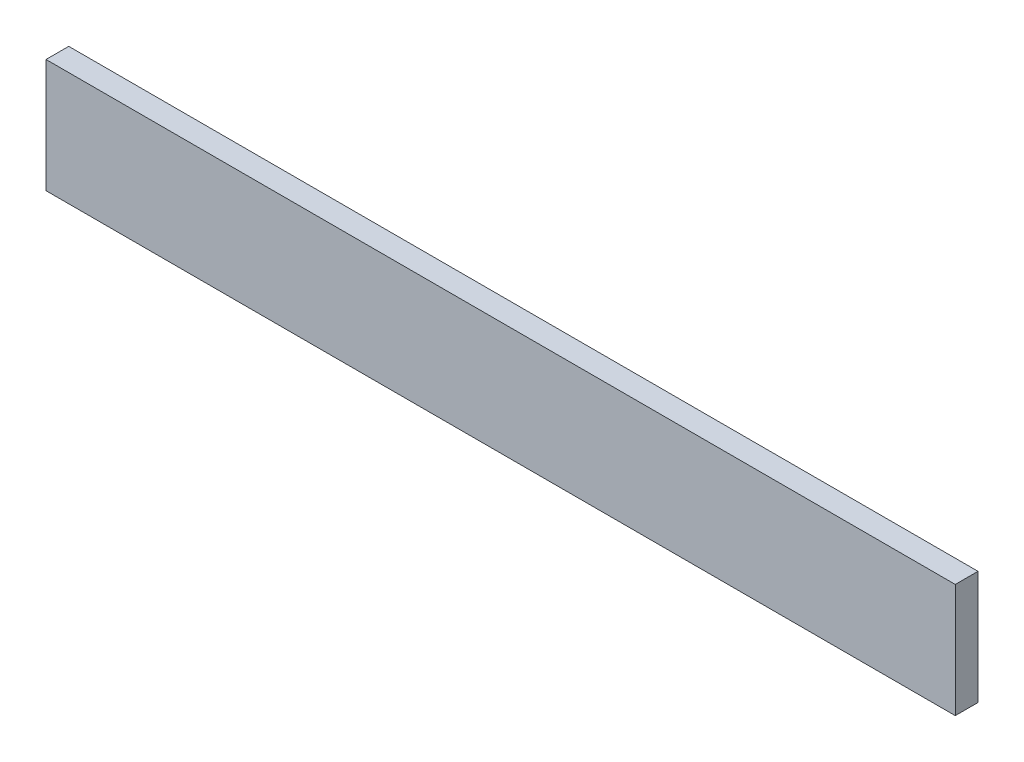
ISO-10303-21;
HEADER;
FILE_DESCRIPTION(('STEP AP214'),'2;1');
FILE_NAME('part.step','',(''),(''),'','','');
FILE_SCHEMA(('AUTOMOTIVE_DESIGN { 1 0 10303 214 1 1 1 1 }'));
ENDSEC;
DATA;
#1=APPLICATION_CONTEXT('core data for automotive mechanical design processes');
#2=APPLICATION_PROTOCOL_DEFINITION('international standard','automotive_design',2000,#1);
#3=PRODUCT_CONTEXT('',#1,'mechanical');
#4=PRODUCT('Part','Part','',(#3));
#5=PRODUCT_RELATED_PRODUCT_CATEGORY('part','',(#4));
#6=PRODUCT_DEFINITION_FORMATION('','',#4);
#7=PRODUCT_DEFINITION_CONTEXT('part definition',#1,'design');
#8=PRODUCT_DEFINITION('design','',#6,#7);
#9=PRODUCT_DEFINITION_SHAPE('','',#8);
#10=(LENGTH_UNIT() NAMED_UNIT(*) SI_UNIT(.MILLI.,.METRE.));
#11=(NAMED_UNIT(*) PLANE_ANGLE_UNIT() SI_UNIT($,.RADIAN.));
#12=(NAMED_UNIT(*) SI_UNIT($,.STERADIAN.) SOLID_ANGLE_UNIT());
#13=UNCERTAINTY_MEASURE_WITH_UNIT(LENGTH_MEASURE(1.E-05),#10,'distance_accuracy_value','');
#14=(GEOMETRIC_REPRESENTATION_CONTEXT(3) GLOBAL_UNCERTAINTY_ASSIGNED_CONTEXT((#13)) GLOBAL_UNIT_ASSIGNED_CONTEXT((#10,
#11,#12)) REPRESENTATION_CONTEXT('',''));
#15=CARTESIAN_POINT('',(0.,0.,0.));
#16=DIRECTION('',(0.,0.,1.));
#17=DIRECTION('',(1.,0.,0.));
#18=AXIS2_PLACEMENT_3D('',#15,#16,#17);
#19=CARTESIAN_POINT('',(0.,12.7,0.));
#20=DIRECTION('',(1.,0.,0.));
#21=DIRECTION('',(0.,0.,-1.));
#22=AXIS2_PLACEMENT_3D('',#19,#20,#21);
#23=PLANE('',#22);
#24=DIRECTION('',(0.,0.,1.));
#25=VECTOR('',#24,1.);
#26=CARTESIAN_POINT('',(0.,0.,0.));
#27=LINE('',#26,#25);
#28=CARTESIAN_POINT('',(0.,0.,-2.54));
#29=VERTEX_POINT('',#28);
#30=CARTESIAN_POINT('',(0.,0.,0.));
#31=VERTEX_POINT('',#30);
#32=EDGE_CURVE('E94',#29,#31,#27,.T.);
#33=ORIENTED_EDGE('',*,*,#32,.T.);
#34=DIRECTION('',(0.,-1.,0.));
#35=VECTOR('',#34,1.);
#36=CARTESIAN_POINT('',(0.,12.7,0.));
#37=LINE('',#36,#35);
#38=CARTESIAN_POINT('',(0.,12.7,0.));
#39=VERTEX_POINT('',#38);
#40=EDGE_CURVE('E11',#39,#31,#37,.T.);
#41=ORIENTED_EDGE('',*,*,#40,.F.);
#42=DIRECTION('',(0.,0.,1.));
#43=VECTOR('',#42,1.);
#44=CARTESIAN_POINT('',(0.,12.7,0.));
#45=LINE('',#44,#43);
#46=CARTESIAN_POINT('',(0.,12.7,-2.54));
#47=VERTEX_POINT('',#46);
#48=EDGE_CURVE('E82',#47,#39,#45,.T.);
#49=ORIENTED_EDGE('',*,*,#48,.F.);
#50=DIRECTION('',(0.,-1.,0.));
#51=VECTOR('',#50,1.);
#52=CARTESIAN_POINT('',(0.,12.7,-2.54));
#53=LINE('',#52,#51);
#54=EDGE_CURVE('E90',#47,#29,#53,.T.);
#55=ORIENTED_EDGE('',*,*,#54,.T.);
#56=EDGE_LOOP('',(#33,#41,#49,#55));
#57=FACE_BOUND('',#56,.T.);
#58=ADVANCED_FACE('F31',(#57),#23,.F.);
#59=CARTESIAN_POINT('',(0.,12.7,0.));
#60=DIRECTION('',(0.,0.,-1.));
#61=DIRECTION('',(-1.,0.,0.));
#62=AXIS2_PLACEMENT_3D('',#59,#60,#61);
#63=PLANE('',#62);
#64=DIRECTION('',(1.,0.,0.));
#65=VECTOR('',#64,1.);
#66=CARTESIAN_POINT('',(0.,0.,0.));
#67=LINE('',#66,#65);
#68=CARTESIAN_POINT('',(101.6,0.,0.));
#69=VERTEX_POINT('',#68);
#70=EDGE_CURVE('E86',#31,#69,#67,.T.);
#71=ORIENTED_EDGE('',*,*,#70,.T.);
#72=DIRECTION('',(0.,-1.,0.));
#73=VECTOR('',#72,1.);
#74=CARTESIAN_POINT('',(101.6,12.7,0.));
#75=LINE('',#74,#73);
#76=CARTESIAN_POINT('',(101.6,12.7,0.));
#77=VERTEX_POINT('',#76);
#78=EDGE_CURVE('E39',#77,#69,#75,.T.);
#79=ORIENTED_EDGE('',*,*,#78,.F.);
#80=DIRECTION('',(1.,0.,0.));
#81=VECTOR('',#80,1.);
#82=CARTESIAN_POINT('',(0.,12.7,0.));
#83=LINE('',#82,#81);
#84=EDGE_CURVE('E77',#39,#77,#83,.T.);
#85=ORIENTED_EDGE('',*,*,#84,.F.);
#86=ORIENTED_EDGE('',*,*,#40,.T.);
#87=EDGE_LOOP('',(#71,#79,#85,#86));
#88=FACE_BOUND('',#87,.T.);
#89=ADVANCED_FACE('F85',(#88),#63,.F.);
#90=CARTESIAN_POINT('',(101.6,12.7,0.));
#91=DIRECTION('',(-1.,0.,0.));
#92=DIRECTION('',(0.,0.,1.));
#93=AXIS2_PLACEMENT_3D('',#90,#91,#92);
#94=PLANE('',#93);
#95=DIRECTION('',(0.,0.,-1.));
#96=VECTOR('',#95,1.);
#97=CARTESIAN_POINT('',(101.6,0.,0.));
#98=LINE('',#97,#96);
#99=CARTESIAN_POINT('',(101.6,0.,-2.54));
#100=VERTEX_POINT('',#99);
#101=EDGE_CURVE('E64',#69,#100,#98,.T.);
#102=ORIENTED_EDGE('',*,*,#101,.T.);
#103=DIRECTION('',(0.,-1.,0.));
#104=VECTOR('',#103,1.);
#105=CARTESIAN_POINT('',(101.6,12.7,-2.54));
#106=LINE('',#105,#104);
#107=CARTESIAN_POINT('',(101.6,12.7,-2.54));
#108=VERTEX_POINT('',#107);
#109=EDGE_CURVE('E87',#108,#100,#106,.T.);
#110=ORIENTED_EDGE('',*,*,#109,.F.);
#111=DIRECTION('',(0.,0.,-1.));
#112=VECTOR('',#111,1.);
#113=CARTESIAN_POINT('',(101.6,12.7,0.));
#114=LINE('',#113,#112);
#115=EDGE_CURVE('E80',#77,#108,#114,.T.);
#116=ORIENTED_EDGE('',*,*,#115,.F.);
#117=ORIENTED_EDGE('',*,*,#78,.T.);
#118=EDGE_LOOP('',(#102,#110,#116,#117));
#119=FACE_BOUND('',#118,.T.);
#120=ADVANCED_FACE('F88',(#119),#94,.F.);
#121=CARTESIAN_POINT('',(0.,12.7,-2.54));
#122=DIRECTION('',(0.,0.,1.));
#123=DIRECTION('',(1.,0.,0.));
#124=AXIS2_PLACEMENT_3D('',#121,#122,#123);
#125=PLANE('',#124);
#126=DIRECTION('',(-1.,0.,0.));
#127=VECTOR('',#126,1.);
#128=CARTESIAN_POINT('',(0.,0.,-2.54));
#129=LINE('',#128,#127);
#130=EDGE_CURVE('E70',#100,#29,#129,.T.);
#131=ORIENTED_EDGE('',*,*,#130,.T.);
#132=ORIENTED_EDGE('',*,*,#54,.F.);
#133=DIRECTION('',(-1.,0.,0.));
#134=VECTOR('',#133,1.);
#135=CARTESIAN_POINT('',(0.,12.7,-2.54));
#136=LINE('',#135,#134);
#137=EDGE_CURVE('E47',#108,#47,#136,.T.);
#138=ORIENTED_EDGE('',*,*,#137,.F.);
#139=ORIENTED_EDGE('',*,*,#109,.T.);
#140=EDGE_LOOP('',(#131,#132,#138,#139));
#141=FACE_BOUND('',#140,.T.);
#142=ADVANCED_FACE('F101',(#141),#125,.F.);
#143=CARTESIAN_POINT('',(0.,12.7,-2.54));
#144=DIRECTION('',(0.,-1.,0.));
#145=DIRECTION('',(0.,0.,-1.));
#146=AXIS2_PLACEMENT_3D('',#143,#144,#145);
#147=PLANE('',#146);
#148=ORIENTED_EDGE('',*,*,#48,.T.);
#149=ORIENTED_EDGE('',*,*,#84,.T.);
#150=ORIENTED_EDGE('',*,*,#115,.T.);
#151=ORIENTED_EDGE('',*,*,#137,.T.);
#152=EDGE_LOOP('',(#148,#149,#150,#151));
#153=FACE_BOUND('',#152,.T.);
#154=ADVANCED_FACE('F78',(#153),#147,.F.);
#155=CARTESIAN_POINT('',(0.,0.,-2.54));
#156=DIRECTION('',(0.,-1.,0.));
#157=DIRECTION('',(0.,0.,-1.));
#158=AXIS2_PLACEMENT_3D('',#155,#156,#157);
#159=PLANE('',#158);
#160=ORIENTED_EDGE('',*,*,#32,.F.);
#161=ORIENTED_EDGE('',*,*,#130,.F.);
#162=ORIENTED_EDGE('',*,*,#101,.F.);
#163=ORIENTED_EDGE('',*,*,#70,.F.);
#164=EDGE_LOOP('',(#160,#161,#162,#163));
#165=FACE_BOUND('',#164,.T.);
#166=ADVANCED_FACE('F104',(#165),#159,.T.);
#167=CLOSED_SHELL('',(#58,#89,#120,#142,#154,#166));
#168=MANIFOLD_SOLID_BREP('B2',#167);
#169=ADVANCED_BREP_SHAPE_REPRESENTATION('',(#18,#168),#14);
#170=SHAPE_DEFINITION_REPRESENTATION(#9,#169);
ENDSEC;
END-ISO-10303-21;
